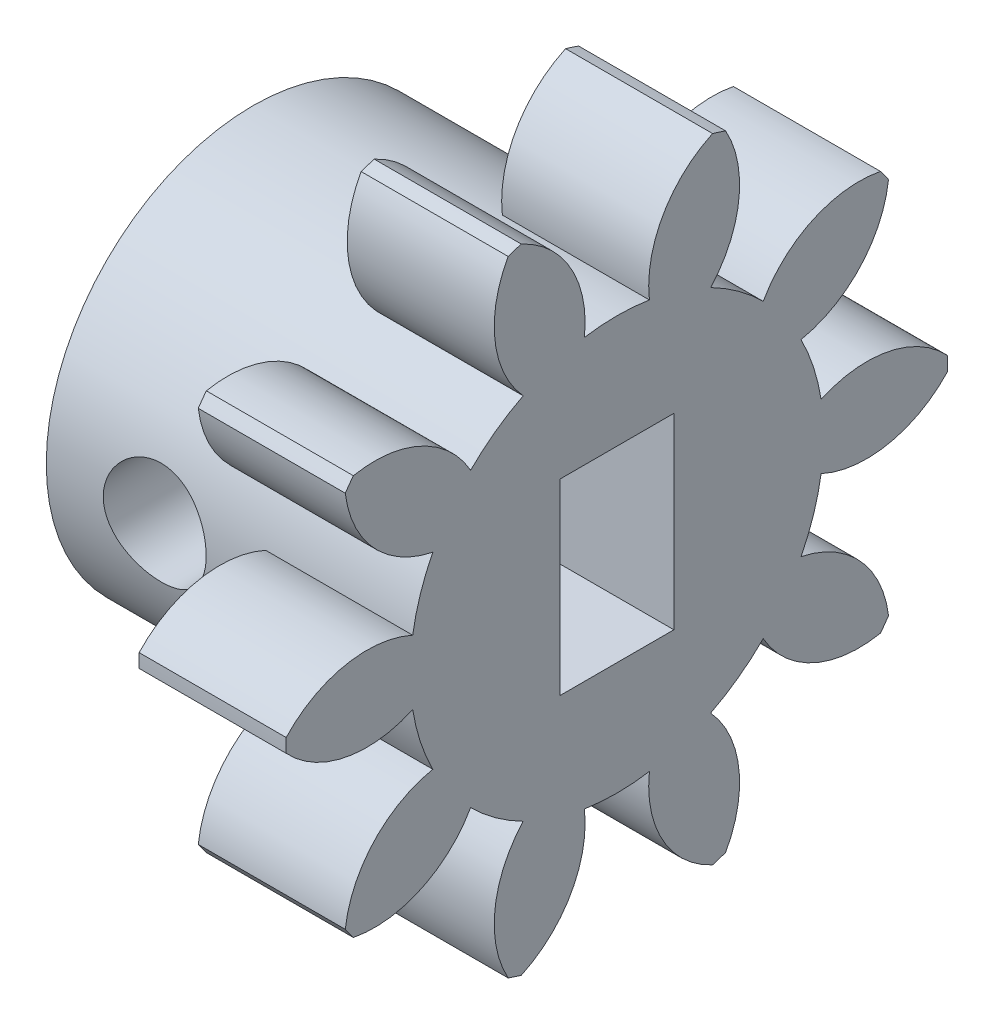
from build123d import *
from build123d.topology import SkipClean

# Parameters (mm, degrees)
BASPROSKE_W              = 4
BASPROSKE_H              = 9
TOOTHCUT_DEPTH           = 14.341664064
TEETHCUTS_COUNT          = 10
TEETHCUTS_ANGLE          = 324
HUBNEARONE_START         = 5.9
HUBNEAONESKE_R           = 5.624
HUBNEARONE_DEPTH         = 5.9
BORSKE_R                 = 2.5
BORE_DEPTH               = 14.0000508
EXTRUDE_1_DEPTH          = 4
EXTRUDE_1_DEPTH_BACK     = 5.9
SKETCH_1_R               = 2.5
CUT_EXTRUDE_1_DEPTH      = 14.785320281
CUT_EXTRUDE_1_DEPTH_BACK = 14.785320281
SKETCH_3_R               = 1.4
CUT_EXTRUDE_2_DEPTH      = 14.785320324
CUT_EXTRUDE_2_DEPTH_BACK = 14.785320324
SKETCH_4_W               = 3.1
SKETCH_4_H               = 5.1
CUT_EXTRUDE_START        = -5.9
SKETCH_5_R               = 2.55
CUT_EXTRUDE_3_DEPTH      = 2


with BuildPart() as part:
    # BasProSke → Base-Revolve (revolve)
    with BuildSketch(Plane(origin=(0, 0, 0), x_dir=(1, 0, 0), z_dir=(0, 1, 0)), mode=Mode.PRIVATE) as base_revolve_sk:
        with Locations((2, 4.5)):
            Rectangle(BASPROSKE_W, BASPROSKE_H)
    revolve(base_revolve_sk.sketch.rotate(Axis((-10, 0, 0), (1, 0, 0)), 180), axis=Axis((-10, 0, 0), (1, 0, 0)))

    # TooCutSke → ToothCut (cut, through all)
    with BuildSketch(Plane(origin=(0, 0, 0), x_dir=(0, 0, -1), z_dir=(1, 0, 0))):
        with BuildLine():
            ThreePointArc((0.883878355, 5.554109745), (0, 5.624), (-0.883878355, 5.554109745))
            ThreePointArc((-0.883878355, 5.554109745), (-1.258245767, 7.379188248), (-2.637816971, 8.631324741))
            ThreePointArc((-2.637816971, 8.631324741), (0, 9.0254), (2.637816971, 8.631324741))
            ThreePointArc((2.637816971, 8.631324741), (1.258245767, 7.379188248), (0.883878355, 5.554109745))
        make_face()
    toothcut = extrude(amount=TOOTHCUT_DEPTH, mode=Mode.SUBTRACT)

    # TeethCuts: ToothCut ×10 about axis
    teethcuts_axis = Axis((-10, 0, 0), (1, 0, 0))
    for i in range(1, TEETHCUTS_COUNT):
        add(toothcut.rotate(teethcuts_axis, i * TEETHCUTS_ANGLE / (TEETHCUTS_COUNT - 1)), mode=Mode.SUBTRACT)

    # HubNeaOneSke → HubNearOne (add)
    with SkipClean():  # the faces are left unmerged after this step: merging them gives an invalid solid
        with BuildSketch(Plane.ZY.offset(HUBNEARONE_START)):
            Circle(HUBNEAONESKE_R)
        extrude(amount=-HUBNEARONE_DEPTH)

    # BorSke → Bore (cut, symmetric)
    with SkipClean():  # the faces are left unmerged after this step: merging them gives an invalid solid
        with BuildSketch(Plane(origin=(0, 0, 0), x_dir=(0, 0, -1), z_dir=(1, 0, 0))):
            with Locations(Location((0, 0, 0), (0, 0, 180))):
                Circle(BORSKE_R)
        extrude(amount=BORE_DEPTH, both=True, mode=Mode.SUBTRACT)

    # Sketch 1 → Extrude 1 (add, two sides: drawn at the far end of the back side and taken through both)
    with SkipClean():  # the faces are left unmerged after this step: merging them gives an invalid solid
        with BuildSketch(Plane(origin=(0, 0, 0), x_dir=(0, 0, -1), z_dir=(1, 0, 0)).offset(-EXTRUDE_1_DEPTH_BACK)):
            Circle(SKETCH_1_R)
        extrude(amount=EXTRUDE_1_DEPTH + EXTRUDE_1_DEPTH_BACK)

    # Sketch 3 → Cut-Extrude 1 (cut, two sides: drawn at the far end of the back side and taken through both)
    with SkipClean():  # the faces are left unmerged after this step: merging them gives an invalid solid
        with BuildSketch(Plane.XY.offset(-CUT_EXTRUDE_1_DEPTH_BACK)):
            with Locations((-2.95, 0)):
                Circle(SKETCH_3_R)
        extrude(amount=CUT_EXTRUDE_1_DEPTH + CUT_EXTRUDE_1_DEPTH_BACK, mode=Mode.SUBTRACT)

    # Sketch 4 → Cut-Extrude 2 (cut, two sides: drawn at the far end of the back side and taken through both)
    with SkipClean():  # the faces are left unmerged after this step: merging them gives an invalid solid
        with BuildSketch(Plane(origin=(0, 0, 0), x_dir=(0, 0, -1), z_dir=(1, 0, 0)).offset(-CUT_EXTRUDE_2_DEPTH_BACK)):
            Rectangle(SKETCH_4_W, SKETCH_4_H)
        extrude(amount=CUT_EXTRUDE_2_DEPTH + CUT_EXTRUDE_2_DEPTH_BACK, mode=Mode.SUBTRACT)

    # Sketch 5 → Cut-Extrude 3 (cut)
    with SkipClean():  # the faces are left unmerged after this step: merging them gives an invalid solid
        with BuildSketch(Plane(origin=(0, 0, 0), x_dir=(0, 0, -1), z_dir=(1, 0, 0)).offset(CUT_EXTRUDE_START)):
            Circle(SKETCH_5_R)
        extrude(amount=CUT_EXTRUDE_3_DEPTH, mode=Mode.SUBTRACT)


solid = part.part
